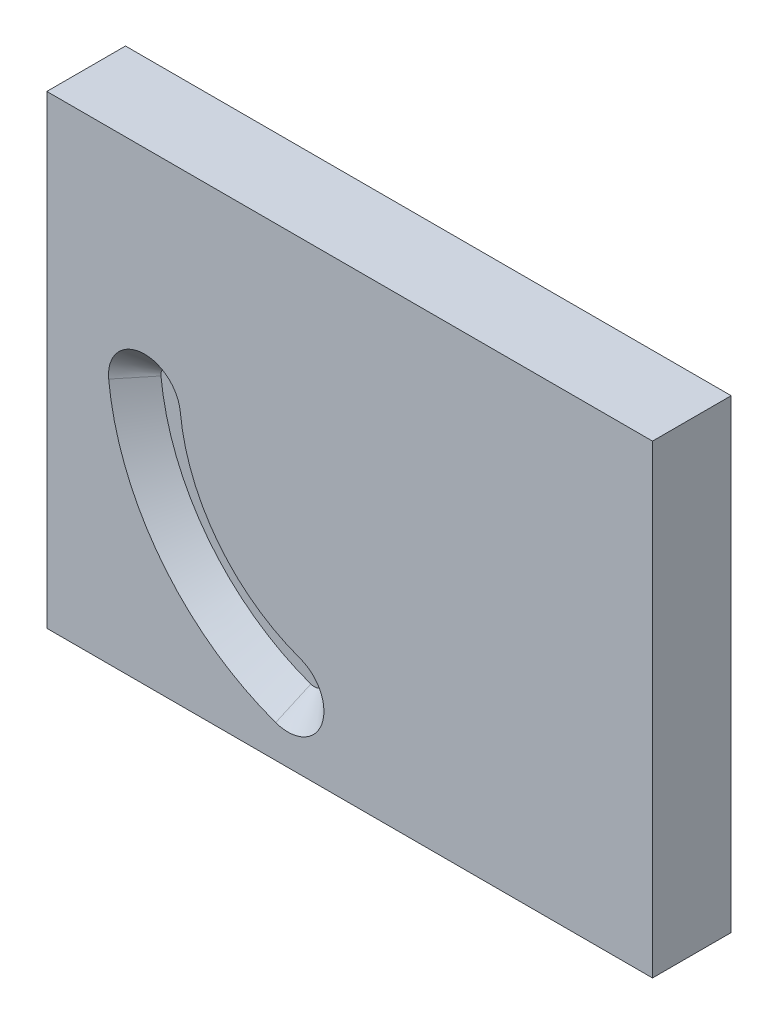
ISO-10303-21;
HEADER;
FILE_DESCRIPTION(('STEP AP214'),'2;1');
FILE_NAME('part.step','',(''),(''),'','','');
FILE_SCHEMA(('AUTOMOTIVE_DESIGN { 1 0 10303 214 1 1 1 1 }'));
ENDSEC;
DATA;
#1=APPLICATION_CONTEXT('core data for automotive mechanical design processes');
#2=APPLICATION_PROTOCOL_DEFINITION('international standard','automotive_design',2000,#1);
#3=PRODUCT_CONTEXT('',#1,'mechanical');
#4=PRODUCT('Part','Part','',(#3));
#5=PRODUCT_RELATED_PRODUCT_CATEGORY('part','',(#4));
#6=PRODUCT_DEFINITION_FORMATION('','',#4);
#7=PRODUCT_DEFINITION_CONTEXT('part definition',#1,'design');
#8=PRODUCT_DEFINITION('design','',#6,#7);
#9=PRODUCT_DEFINITION_SHAPE('','',#8);
#10=(LENGTH_UNIT() NAMED_UNIT(*) SI_UNIT(.MILLI.,.METRE.));
#11=(NAMED_UNIT(*) PLANE_ANGLE_UNIT() SI_UNIT($,.RADIAN.));
#12=(NAMED_UNIT(*) SI_UNIT($,.STERADIAN.) SOLID_ANGLE_UNIT());
#13=UNCERTAINTY_MEASURE_WITH_UNIT(LENGTH_MEASURE(1.E-05),#10,'distance_accuracy_value','');
#14=(GEOMETRIC_REPRESENTATION_CONTEXT(3) GLOBAL_UNCERTAINTY_ASSIGNED_CONTEXT((#13)) GLOBAL_UNIT_ASSIGNED_CONTEXT((#10,
#11,#12)) REPRESENTATION_CONTEXT('',''));
#15=CARTESIAN_POINT('',(0.,0.,0.));
#16=DIRECTION('',(0.,0.,1.));
#17=DIRECTION('',(1.,0.,0.));
#18=AXIS2_PLACEMENT_3D('',#15,#16,#17);
#19=CARTESIAN_POINT('',(0.,88.6657281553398,0.));
#20=DIRECTION('',(0.,0.,-1.));
#21=DIRECTION('',(-1.,0.,0.));
#22=AXIS2_PLACEMENT_3D('',#19,#20,#21);
#23=PLANE('',#22);
#24=DIRECTION('',(0.,1.,0.));
#25=VECTOR('',#24,1.);
#26=CARTESIAN_POINT('',(0.,0.,0.));
#27=LINE('',#26,#25);
#28=CARTESIAN_POINT('',(0.,0.,0.));
#29=VERTEX_POINT('',#28);
#30=CARTESIAN_POINT('',(0.,88.6657281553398,0.));
#31=VERTEX_POINT('',#30);
#32=EDGE_CURVE('E135',#29,#31,#27,.T.);
#33=ORIENTED_EDGE('',*,*,#32,.F.);
#34=DIRECTION('',(1.,0.,0.));
#35=VECTOR('',#34,1.);
#36=CARTESIAN_POINT('',(0.,0.,0.));
#37=LINE('',#36,#35);
#38=CARTESIAN_POINT('',(115.496019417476,0.,0.));
#39=VERTEX_POINT('',#38);
#40=EDGE_CURVE('E147',#29,#39,#37,.T.);
#41=ORIENTED_EDGE('',*,*,#40,.T.);
#42=DIRECTION('',(0.,1.,0.));
#43=VECTOR('',#42,1.);
#44=CARTESIAN_POINT('',(115.496019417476,0.,0.));
#45=LINE('',#44,#43);
#46=CARTESIAN_POINT('',(115.496019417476,88.6657281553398,0.));
#47=VERTEX_POINT('',#46);
#48=EDGE_CURVE('E158',#39,#47,#45,.T.);
#49=ORIENTED_EDGE('',*,*,#48,.T.);
#50=DIRECTION('',(1.,0.,0.));
#51=VECTOR('',#50,1.);
#52=CARTESIAN_POINT('',(0.,88.6657281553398,0.));
#53=LINE('',#52,#51);
#54=EDGE_CURVE('E155',#31,#47,#53,.T.);
#55=ORIENTED_EDGE('',*,*,#54,.F.);
#56=EDGE_LOOP('',(#33,#41,#49,#55));
#57=FACE_BOUND('',#56,.T.);
#58=CARTESIAN_POINT('',(45.9754465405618,12.715681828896,0.));
#59=DIRECTION('',(0.,0.,-1.));
#60=DIRECTION('',(-1.,0.,0.));
#61=AXIS2_PLACEMENT_3D('',#58,#59,#60);
#62=CIRCLE('',#61,6.86455668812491);
#63=CARTESIAN_POINT('',(48.3073891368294,19.1720106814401,0.));
#64=VERTEX_POINT('',#63);
#65=CARTESIAN_POINT('',(43.6435039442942,6.25935297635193,0.));
#66=VERTEX_POINT('',#65);
#67=EDGE_CURVE('E48',#64,#66,#62,.T.);
#68=ORIENTED_EDGE('',*,*,#67,.T.);
#69=CARTESIAN_POINT('',(60.1585436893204,51.9836893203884,0.));
#70=DIRECTION('',(0.,0.,-1.));
#71=DIRECTION('',(-1.,0.,0.));
#72=AXIS2_PLACEMENT_3D('',#69,#70,#71);
#73=CIRCLE('',#72,48.6154447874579);
#74=CARTESIAN_POINT('',(11.7939768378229,47.0511296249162,0.));
#75=VERTEX_POINT('',#74);
#76=EDGE_CURVE('E127',#66,#75,#73,.T.);
#77=ORIENTED_EDGE('',*,*,#76,.T.);
#78=CARTESIAN_POINT('',(18.6231092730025,47.7476127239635,0.));
#79=DIRECTION('',(0.,0.,-1.));
#80=DIRECTION('',(-1.,0.,0.));
#81=AXIS2_PLACEMENT_3D('',#78,#79,#80);
#82=CIRCLE('',#81,6.86455668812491);
#83=CARTESIAN_POINT('',(25.4522417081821,48.4440958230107,0.));
#84=VERTEX_POINT('',#83);
#85=EDGE_CURVE('E112',#75,#84,#82,.T.);
#86=ORIENTED_EDGE('',*,*,#85,.T.);
#87=CARTESIAN_POINT('',(60.1585436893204,51.9836893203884,0.));
#88=DIRECTION('',(0.,0.,-1.));
#89=DIRECTION('',(-1.,0.,0.));
#90=AXIS2_PLACEMENT_3D('',#87,#88,#89);
#91=CIRCLE('',#90,34.8863314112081);
#92=EDGE_CURVE('E123',#64,#84,#91,.T.);
#93=ORIENTED_EDGE('',*,*,#92,.F.);
#94=EDGE_LOOP('',(#68,#77,#86,#93));
#95=FACE_BOUND('',#94,.T.);
#96=ADVANCED_FACE('F33',(#57,#95),#23,.F.);
#97=CARTESIAN_POINT('',(0.,0.,-15.));
#98=DIRECTION('',(1.,0.,0.));
#99=DIRECTION('',(0.,0.,-1.));
#100=AXIS2_PLACEMENT_3D('',#97,#98,#99);
#101=PLANE('',#100);
#102=ORIENTED_EDGE('',*,*,#32,.T.);
#103=DIRECTION('',(0.,0.,1.));
#104=VECTOR('',#103,1.);
#105=CARTESIAN_POINT('',(0.,88.6657281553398,-15.));
#106=LINE('',#105,#104);
#107=CARTESIAN_POINT('',(0.,88.6657281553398,-15.));
#108=VERTEX_POINT('',#107);
#109=EDGE_CURVE('E11',#108,#31,#106,.T.);
#110=ORIENTED_EDGE('',*,*,#109,.F.);
#111=DIRECTION('',(0.,1.,0.));
#112=VECTOR('',#111,1.);
#113=CARTESIAN_POINT('',(0.,0.,-15.));
#114=LINE('',#113,#112);
#115=CARTESIAN_POINT('',(0.,0.,-15.));
#116=VERTEX_POINT('',#115);
#117=EDGE_CURVE('E145',#116,#108,#114,.T.);
#118=ORIENTED_EDGE('',*,*,#117,.F.);
#119=DIRECTION('',(0.,0.,1.));
#120=VECTOR('',#119,1.);
#121=CARTESIAN_POINT('',(0.,0.,-15.));
#122=LINE('',#121,#120);
#123=EDGE_CURVE('E57',#116,#29,#122,.T.);
#124=ORIENTED_EDGE('',*,*,#123,.T.);
#125=EDGE_LOOP('',(#102,#110,#118,#124));
#126=FACE_BOUND('',#125,.T.);
#127=ADVANCED_FACE('F35',(#126),#101,.F.);
#128=CARTESIAN_POINT('',(0.,88.6657281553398,-15.));
#129=DIRECTION('',(0.,-1.,0.));
#130=DIRECTION('',(0.,0.,-1.));
#131=AXIS2_PLACEMENT_3D('',#128,#129,#130);
#132=PLANE('',#131);
#133=ORIENTED_EDGE('',*,*,#54,.T.);
#134=DIRECTION('',(0.,0.,1.));
#135=VECTOR('',#134,1.);
#136=CARTESIAN_POINT('',(115.496019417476,88.6657281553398,-15.));
#137=LINE('',#136,#135);
#138=CARTESIAN_POINT('',(115.496019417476,88.6657281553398,-15.));
#139=VERTEX_POINT('',#138);
#140=EDGE_CURVE('E41',#139,#47,#137,.T.);
#141=ORIENTED_EDGE('',*,*,#140,.F.);
#142=DIRECTION('',(1.,0.,0.));
#143=VECTOR('',#142,1.);
#144=CARTESIAN_POINT('',(0.,88.6657281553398,-15.));
#145=LINE('',#144,#143);
#146=EDGE_CURVE('E83',#108,#139,#145,.T.);
#147=ORIENTED_EDGE('',*,*,#146,.F.);
#148=ORIENTED_EDGE('',*,*,#109,.T.);
#149=EDGE_LOOP('',(#133,#141,#147,#148));
#150=FACE_BOUND('',#149,.T.);
#151=ADVANCED_FACE('F169',(#150),#132,.F.);
#152=CARTESIAN_POINT('',(115.496019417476,0.,-15.));
#153=DIRECTION('',(1.,0.,0.));
#154=DIRECTION('',(0.,0.,-1.));
#155=AXIS2_PLACEMENT_3D('',#152,#153,#154);
#156=PLANE('',#155);
#157=ORIENTED_EDGE('',*,*,#48,.F.);
#158=DIRECTION('',(0.,0.,1.));
#159=VECTOR('',#158,1.);
#160=CARTESIAN_POINT('',(115.496019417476,0.,-15.));
#161=LINE('',#160,#159);
#162=CARTESIAN_POINT('',(115.496019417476,0.,-15.));
#163=VERTEX_POINT('',#162);
#164=EDGE_CURVE('E164',#163,#39,#161,.T.);
#165=ORIENTED_EDGE('',*,*,#164,.F.);
#166=DIRECTION('',(0.,1.,0.));
#167=VECTOR('',#166,1.);
#168=CARTESIAN_POINT('',(115.496019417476,0.,-15.));
#169=LINE('',#168,#167);
#170=EDGE_CURVE('E149',#163,#139,#169,.T.);
#171=ORIENTED_EDGE('',*,*,#170,.T.);
#172=ORIENTED_EDGE('',*,*,#140,.T.);
#173=EDGE_LOOP('',(#157,#165,#171,#172));
#174=FACE_BOUND('',#173,.T.);
#175=ADVANCED_FACE('F167',(#174),#156,.T.);
#176=CARTESIAN_POINT('',(0.,0.,-15.));
#177=DIRECTION('',(0.,-1.,0.));
#178=DIRECTION('',(0.,0.,-1.));
#179=AXIS2_PLACEMENT_3D('',#176,#177,#178);
#180=PLANE('',#179);
#181=ORIENTED_EDGE('',*,*,#40,.F.);
#182=ORIENTED_EDGE('',*,*,#123,.F.);
#183=DIRECTION('',(1.,0.,0.));
#184=VECTOR('',#183,1.);
#185=CARTESIAN_POINT('',(0.,0.,-15.));
#186=LINE('',#185,#184);
#187=EDGE_CURVE('E152',#116,#163,#186,.T.);
#188=ORIENTED_EDGE('',*,*,#187,.T.);
#189=ORIENTED_EDGE('',*,*,#164,.T.);
#190=EDGE_LOOP('',(#181,#182,#188,#189));
#191=FACE_BOUND('',#190,.T.);
#192=ADVANCED_FACE('F172',(#191),#180,.T.);
#193=CARTESIAN_POINT('',(0.,88.6657281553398,-15.));
#194=DIRECTION('',(0.,0.,-1.));
#195=DIRECTION('',(-1.,0.,0.));
#196=AXIS2_PLACEMENT_3D('',#193,#194,#195);
#197=PLANE('',#196);
#198=ORIENTED_EDGE('',*,*,#117,.T.);
#199=ORIENTED_EDGE('',*,*,#146,.T.);
#200=ORIENTED_EDGE('',*,*,#170,.F.);
#201=ORIENTED_EDGE('',*,*,#187,.F.);
#202=EDGE_LOOP('',(#198,#199,#200,#201));
#203=FACE_BOUND('',#202,.T.);
#204=ADVANCED_FACE('F175',(#203),#197,.T.);
#205=CARTESIAN_POINT('',(45.9754465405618,12.715681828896,0.));
#206=DIRECTION('',(0.,0.,1.));
#207=DIRECTION('',(-1.,0.,0.));
#208=AXIS2_PLACEMENT_3D('',#205,#206,#207);
#209=CONICAL_SURFACE('',#208,6.86455668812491,0.78539816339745);
#210=ORIENTED_EDGE('',*,*,#67,.F.);
#211=DIRECTION('',(0.240209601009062,0.665055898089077,0.707106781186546));
#212=VECTOR('',#211,1.);
#213=CARTESIAN_POINT('',(48.3073891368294,19.1720106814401,0.));
#214=LINE('',#213,#212);
#215=CARTESIAN_POINT('',(46.6088507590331,14.4693553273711,-5.));
#216=VERTEX_POINT('',#215);
#217=EDGE_CURVE('E120',#216,#64,#214,.T.);
#218=ORIENTED_EDGE('',*,*,#217,.F.);
#219=CARTESIAN_POINT('',(45.9754465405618,12.715681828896,-5.));
#220=DIRECTION('',(0.,0.,-1.));
#221=DIRECTION('',(-1.,0.,0.));
#222=AXIS2_PLACEMENT_3D('',#219,#220,#221);
#223=CIRCLE('',#222,1.8645566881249);
#224=CARTESIAN_POINT('',(45.3420423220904,10.9620083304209,-5.));
#225=VERTEX_POINT('',#224);
#226=EDGE_CURVE('E129',#216,#225,#223,.T.);
#227=ORIENTED_EDGE('',*,*,#226,.T.);
#228=DIRECTION('',(-0.240209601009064,-0.665055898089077,0.707106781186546));
#229=VECTOR('',#228,1.);
#230=CARTESIAN_POINT('',(43.6435039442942,6.25935297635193,0.));
#231=LINE('',#230,#229);
#232=EDGE_CURVE('E133',#225,#66,#231,.T.);
#233=ORIENTED_EDGE('',*,*,#232,.T.);
#234=EDGE_LOOP('',(#210,#218,#227,#233));
#235=FACE_BOUND('',#234,.T.);
#236=ADVANCED_FACE('F204',(#235),#209,.F.);
#237=CARTESIAN_POINT('',(60.1585436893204,51.9836893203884,0.));
#238=DIRECTION('',(0.,0.,1.));
#239=DIRECTION('',(-1.,0.,0.));
#240=AXIS2_PLACEMENT_3D('',#237,#238,#239);
#241=CONICAL_SURFACE('',#240,48.6154447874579,0.78539816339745);
#242=ORIENTED_EDGE('',*,*,#76,.F.);
#243=ORIENTED_EDGE('',*,*,#232,.F.);
#244=CARTESIAN_POINT('',(60.1585436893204,51.9836893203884,-5.));
#245=DIRECTION('',(0.,0.,-1.));
#246=DIRECTION('',(-1.,0.,0.));
#247=AXIS2_PLACEMENT_3D('',#244,#245,#246);
#248=CIRCLE('',#247,43.6154447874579);
#249=CARTESIAN_POINT('',(16.7681745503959,47.5584333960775,-5.));
#250=VERTEX_POINT('',#249);
#251=EDGE_CURVE('E136',#225,#250,#248,.T.);
#252=ORIENTED_EDGE('',*,*,#251,.T.);
#253=DIRECTION('',(-0.703457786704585,-0.0717435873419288,0.707106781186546));
#254=VECTOR('',#253,1.);
#255=CARTESIAN_POINT('',(11.7939768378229,47.0511296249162,0.));
#256=LINE('',#255,#254);
#257=EDGE_CURVE('E119',#250,#75,#256,.T.);
#258=ORIENTED_EDGE('',*,*,#257,.T.);
#259=EDGE_LOOP('',(#242,#243,#252,#258));
#260=FACE_BOUND('',#259,.T.);
#261=ADVANCED_FACE('F210',(#260),#241,.F.);
#262=CARTESIAN_POINT('',(18.6231092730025,47.7476127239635,0.));
#263=DIRECTION('',(0.,0.,1.));
#264=DIRECTION('',(-1.,0.,0.));
#265=AXIS2_PLACEMENT_3D('',#262,#263,#264);
#266=CONICAL_SURFACE('',#265,6.86455668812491,0.78539816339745);
#267=ORIENTED_EDGE('',*,*,#85,.F.);
#268=ORIENTED_EDGE('',*,*,#257,.F.);
#269=CARTESIAN_POINT('',(18.6231092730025,47.7476127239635,-5.));
#270=DIRECTION('',(0.,0.,-1.));
#271=DIRECTION('',(-1.,0.,0.));
#272=AXIS2_PLACEMENT_3D('',#269,#270,#271);
#273=CIRCLE('',#272,1.86455668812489);
#274=CARTESIAN_POINT('',(20.4780439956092,47.9367920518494,-5.));
#275=VERTEX_POINT('',#274);
#276=EDGE_CURVE('E115',#250,#275,#273,.T.);
#277=ORIENTED_EDGE('',*,*,#276,.T.);
#278=DIRECTION('',(0.703457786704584,0.0717435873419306,0.707106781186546));
#279=VECTOR('',#278,1.);
#280=CARTESIAN_POINT('',(25.4522417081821,48.4440958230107,0.));
#281=LINE('',#280,#279);
#282=EDGE_CURVE('E107',#275,#84,#281,.T.);
#283=ORIENTED_EDGE('',*,*,#282,.T.);
#284=EDGE_LOOP('',(#267,#268,#277,#283));
#285=FACE_BOUND('',#284,.T.);
#286=ADVANCED_FACE('F109',(#285),#266,.F.);
#287=CARTESIAN_POINT('',(60.1585436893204,51.9836893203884,0.));
#288=DIRECTION('',(0.,0.,-1.));
#289=DIRECTION('',(-1.,0.,0.));
#290=AXIS2_PLACEMENT_3D('',#287,#288,#289);
#291=CONICAL_SURFACE('',#290,34.8863314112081,0.78539816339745);
#292=ORIENTED_EDGE('',*,*,#92,.T.);
#293=ORIENTED_EDGE('',*,*,#282,.F.);
#294=CARTESIAN_POINT('',(60.1585436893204,51.9836893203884,-5.));
#295=DIRECTION('',(0.,0.,-1.));
#296=DIRECTION('',(-1.,0.,0.));
#297=AXIS2_PLACEMENT_3D('',#294,#295,#296);
#298=CIRCLE('',#297,39.8863314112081);
#299=EDGE_CURVE('E141',#216,#275,#298,.T.);
#300=ORIENTED_EDGE('',*,*,#299,.F.);
#301=ORIENTED_EDGE('',*,*,#217,.T.);
#302=EDGE_LOOP('',(#292,#293,#300,#301));
#303=FACE_BOUND('',#302,.T.);
#304=ADVANCED_FACE('F124',(#303),#291,.T.);
#305=CARTESIAN_POINT('',(-55.6478588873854,44.3328640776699,-5.));
#306=DIRECTION('',(0.,0.,-1.));
#307=DIRECTION('',(-1.,0.,0.));
#308=AXIS2_PLACEMENT_3D('',#305,#306,#307);
#309=PLANE('',#308);
#310=ORIENTED_EDGE('',*,*,#226,.F.);
#311=ORIENTED_EDGE('',*,*,#299,.T.);
#312=ORIENTED_EDGE('',*,*,#276,.F.);
#313=ORIENTED_EDGE('',*,*,#251,.F.);
#314=EDGE_LOOP('',(#310,#311,#312,#313));
#315=FACE_BOUND('',#314,.T.);
#316=ADVANCED_FACE('F229',(#315),#309,.F.);
#317=CLOSED_SHELL('',(#96,#127,#151,#175,#192,#204,#236,#261,#286,#304,#316));
#318=MANIFOLD_SOLID_BREP('B2',#317);
#319=ADVANCED_BREP_SHAPE_REPRESENTATION('',(#18,#318),#14);
#320=SHAPE_DEFINITION_REPRESENTATION(#9,#319);
ENDSEC;
END-ISO-10303-21;
